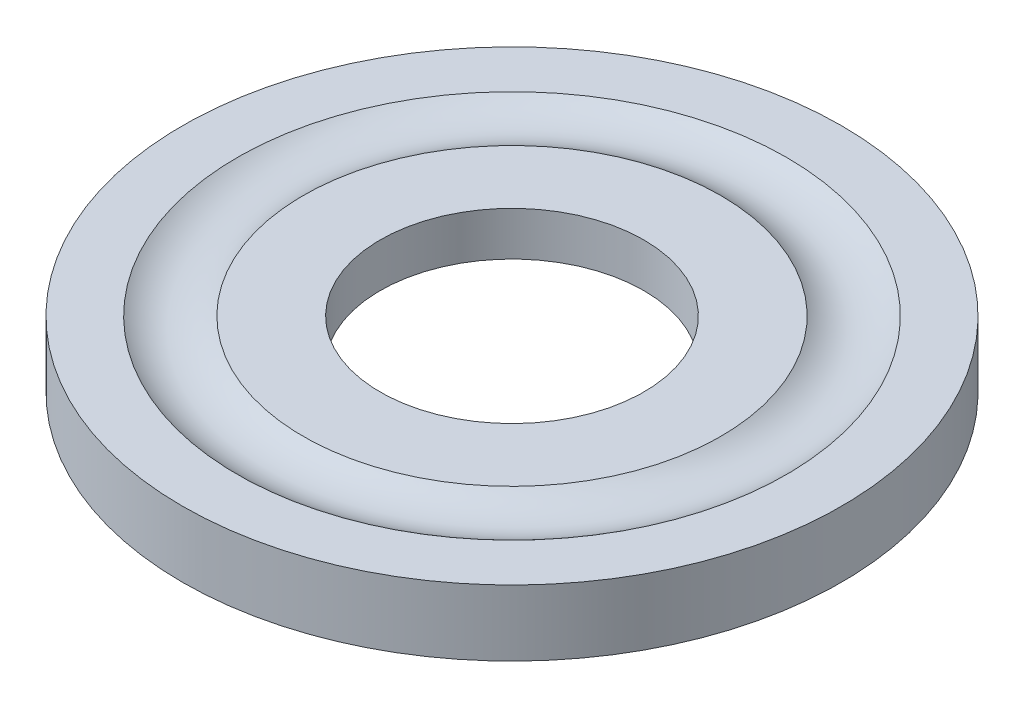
from build123d import *


with BuildPart() as part:
    # Esquisse1 → Base-R_volution (revolve)
    with BuildSketch(Plane.XY, mode=Mode.PRIVATE) as base_r_volution_sk:
        with BuildLine():
            Line((-6, 0), (-13, 0))
            Line((-13, 0), (-13, -1))
            Line((-13, -1), (-15, -1))
            Line((-15, -1), (-15, 2))
            Line((-15, 2), (-12.5, 2))
            ThreePointArc((-12.5, 2), (-11, 1.5), (-9.5, 2))
            Line((-9.5, 2), (-6, 2))
            Line((-6, 2), (-6, 0))
        make_face()
    revolve(base_r_volution_sk.sketch.rotate(Axis((0, 0, 0), (0, 1, 0)), 270), axis=Axis((0, 0, 0), (0, 1, 0)))


solid = part.part
